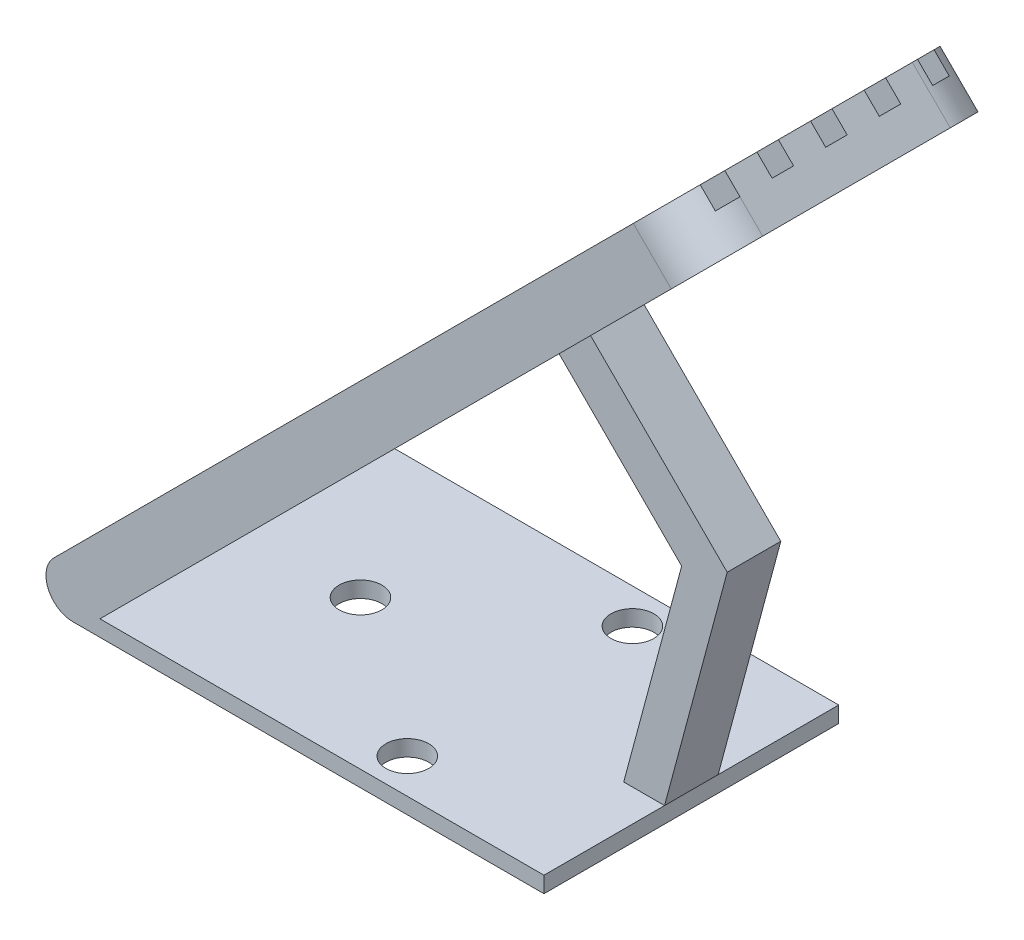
ISO-10303-21;
HEADER;
FILE_DESCRIPTION(('STEP AP214'),'2;1');
FILE_NAME('part.step','',(''),(''),'','','');
FILE_SCHEMA(('AUTOMOTIVE_DESIGN { 1 0 10303 214 1 1 1 1 }'));
ENDSEC;
DATA;
#1=APPLICATION_CONTEXT('core data for automotive mechanical design processes');
#2=APPLICATION_PROTOCOL_DEFINITION('international standard','automotive_design',2000,#1);
#3=PRODUCT_CONTEXT('',#1,'mechanical');
#4=PRODUCT('Part','Part','',(#3));
#5=PRODUCT_RELATED_PRODUCT_CATEGORY('part','',(#4));
#6=PRODUCT_DEFINITION_FORMATION('','',#4);
#7=PRODUCT_DEFINITION_CONTEXT('part definition',#1,'design');
#8=PRODUCT_DEFINITION('design','',#6,#7);
#9=PRODUCT_DEFINITION_SHAPE('','',#8);
#10=(LENGTH_UNIT() NAMED_UNIT(*) SI_UNIT(.MILLI.,.METRE.));
#11=(NAMED_UNIT(*) PLANE_ANGLE_UNIT() SI_UNIT($,.RADIAN.));
#12=(NAMED_UNIT(*) SI_UNIT($,.STERADIAN.) SOLID_ANGLE_UNIT());
#13=UNCERTAINTY_MEASURE_WITH_UNIT(LENGTH_MEASURE(1.E-05),#10,'distance_accuracy_value','');
#14=(GEOMETRIC_REPRESENTATION_CONTEXT(3) GLOBAL_UNCERTAINTY_ASSIGNED_CONTEXT((#13)) GLOBAL_UNIT_ASSIGNED_CONTEXT((#10,
#11,#12)) REPRESENTATION_CONTEXT('',''));
#15=CARTESIAN_POINT('',(0.,0.,0.));
#16=DIRECTION('',(0.,0.,1.));
#17=DIRECTION('',(1.,0.,0.));
#18=AXIS2_PLACEMENT_3D('',#15,#16,#17);
#19=CARTESIAN_POINT('',(-49.9999999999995,50.,27.5));
#20=DIRECTION('',(-0.707106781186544,0.707106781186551,0.));
#21=DIRECTION('',(-0.707106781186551,-0.707106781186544,0.));
#22=AXIS2_PLACEMENT_3D('',#19,#20,#21);
#23=PLANE('',#22);
#24=DIRECTION('',(0.70710678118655,0.707106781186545,0.));
#25=VECTOR('',#24,1.);
#26=CARTESIAN_POINT('',(-96.4644660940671,3.5355339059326,11.5));
#27=LINE('',#26,#25);
#28=CARTESIAN_POINT('',(-91.464466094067,8.53553390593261,11.5));
#29=VERTEX_POINT('',#28);
#30=CARTESIAN_POINT('',(23.7436867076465,123.743686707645,11.5));
#31=VERTEX_POINT('',#30);
#32=EDGE_CURVE('E301',#29,#31,#27,.T.);
#33=ORIENTED_EDGE('',*,*,#32,.F.);
#34=DIRECTION('',(0.,0.,-1.));
#35=VECTOR('',#34,1.);
#36=CARTESIAN_POINT('',(-91.4644660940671,8.53553390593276,27.5));
#37=LINE('',#36,#35);
#38=CARTESIAN_POINT('',(-91.464466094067,8.53553390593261,17.5));
#39=VERTEX_POINT('',#38);
#40=EDGE_CURVE('E507',#39,#29,#37,.T.);
#41=ORIENTED_EDGE('',*,*,#40,.F.);
#42=DIRECTION('',(0.70710678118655,0.707106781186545,0.));
#43=VECTOR('',#42,1.);
#44=CARTESIAN_POINT('',(-96.464466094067,3.53553390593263,17.5));
#45=LINE('',#44,#43);
#46=CARTESIAN_POINT('',(23.7436867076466,123.743686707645,17.5));
#47=VERTEX_POINT('',#46);
#48=EDGE_CURVE('E390',#39,#47,#45,.T.);
#49=ORIENTED_EDGE('',*,*,#48,.T.);
#50=DIRECTION('',(0.,0.,-1.));
#51=VECTOR('',#50,1.);
#52=CARTESIAN_POINT('',(23.7436867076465,123.743686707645,27.5));
#53=LINE('',#52,#51);
#54=EDGE_CURVE('E488',#47,#31,#53,.T.);
#55=ORIENTED_EDGE('',*,*,#54,.T.);
#56=EDGE_LOOP('',(#33,#41,#49,#55));
#57=FACE_BOUND('',#56,.T.);
#58=ADVANCED_FACE('F45',(#57),#23,.T.);
#59=DIRECTION('',(0.70710678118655,0.707106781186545,0.));
#60=VECTOR('',#59,1.);
#61=CARTESIAN_POINT('',(-96.4644660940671,3.5355339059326,7.5));
#62=LINE('',#61,#60);
#63=CARTESIAN_POINT('',(-91.464466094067,8.53553390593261,7.5));
#64=VERTEX_POINT('',#63);
#65=CARTESIAN_POINT('',(23.7436867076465,123.743686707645,7.5));
#66=VERTEX_POINT('',#65);
#67=EDGE_CURVE('E279',#64,#66,#62,.T.);
#68=ORIENTED_EDGE('',*,*,#67,.T.);
#69=CARTESIAN_POINT('',(23.7436867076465,123.743686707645,1.5));
#70=VERTEX_POINT('',#69);
#71=EDGE_CURVE('E296',#66,#70,#53,.T.);
#72=ORIENTED_EDGE('',*,*,#71,.T.);
#73=DIRECTION('',(0.70710678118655,0.707106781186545,0.));
#74=VECTOR('',#73,1.);
#75=CARTESIAN_POINT('',(-96.464466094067,3.53553390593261,1.5));
#76=LINE('',#75,#74);
#77=CARTESIAN_POINT('',(-91.464466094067,8.53553390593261,1.5));
#78=VERTEX_POINT('',#77);
#79=EDGE_CURVE('E314',#78,#70,#76,.T.);
#80=ORIENTED_EDGE('',*,*,#79,.F.);
#81=EDGE_CURVE('E579',#64,#78,#37,.T.);
#82=ORIENTED_EDGE('',*,*,#81,.F.);
#83=EDGE_LOOP('',(#68,#72,#80,#82));
#84=FACE_BOUND('',#83,.T.);
#85=ADVANCED_FACE('F651',(#84),#23,.T.);
#86=DIRECTION('',(0.70710678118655,0.707106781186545,0.));
#87=VECTOR('',#86,1.);
#88=CARTESIAN_POINT('',(-96.464466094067,3.53553390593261,-2.5));
#89=LINE('',#88,#87);
#90=CARTESIAN_POINT('',(-91.464466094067,8.53553390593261,-2.5));
#91=VERTEX_POINT('',#90);
#92=CARTESIAN_POINT('',(23.7436867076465,123.743686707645,-2.5));
#93=VERTEX_POINT('',#92);
#94=EDGE_CURVE('E316',#91,#93,#89,.T.);
#95=ORIENTED_EDGE('',*,*,#94,.T.);
#96=CARTESIAN_POINT('',(23.7436867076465,123.743686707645,-8.5));
#97=VERTEX_POINT('',#96);
#98=EDGE_CURVE('E487',#93,#97,#53,.T.);
#99=ORIENTED_EDGE('',*,*,#98,.T.);
#100=DIRECTION('',(0.70710678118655,0.707106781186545,0.));
#101=VECTOR('',#100,1.);
#102=CARTESIAN_POINT('',(-96.464466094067,3.5355339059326,-8.5));
#103=LINE('',#102,#101);
#104=CARTESIAN_POINT('',(-91.464466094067,8.5355339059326,-8.5));
#105=VERTEX_POINT('',#104);
#106=EDGE_CURVE('E308',#105,#97,#103,.T.);
#107=ORIENTED_EDGE('',*,*,#106,.F.);
#108=EDGE_CURVE('E578',#91,#105,#37,.T.);
#109=ORIENTED_EDGE('',*,*,#108,.F.);
#110=EDGE_LOOP('',(#95,#99,#107,#109));
#111=FACE_BOUND('',#110,.T.);
#112=ADVANCED_FACE('F559',(#111),#23,.T.);
#113=CARTESIAN_POINT('',(23.7436867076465,123.743686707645,-12.5));
#114=VERTEX_POINT('',#113);
#115=CARTESIAN_POINT('',(23.7436867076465,123.743686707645,-17.5));
#116=VERTEX_POINT('',#115);
#117=EDGE_CURVE('E469',#114,#116,#53,.T.);
#118=ORIENTED_EDGE('',*,*,#117,.T.);
#119=CARTESIAN_POINT('',(16.672618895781,116.67261889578,-17.5));
#120=DIRECTION('',(-0.707106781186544,0.707106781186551,0.));
#121=DIRECTION('',(-0.707106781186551,-0.707106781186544,0.));
#122=AXIS2_PLACEMENT_3D('',#119,#120,#121);
#123=CIRCLE('',#122,10.);
#124=CARTESIAN_POINT('',(23.7082425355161,123.708242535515,-18.5));
#125=VERTEX_POINT('',#124);
#126=EDGE_CURVE('E519',#116,#125,#123,.T.);
#127=ORIENTED_EDGE('',*,*,#126,.T.);
#128=DIRECTION('',(0.70710678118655,0.707106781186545,0.));
#129=VECTOR('',#128,1.);
#130=CARTESIAN_POINT('',(-96.464466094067,3.5355339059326,-18.5));
#131=LINE('',#130,#129);
#132=CARTESIAN_POINT('',(-91.464466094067,8.53553390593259,-18.5));
#133=VERTEX_POINT('',#132);
#134=EDGE_CURVE('E326',#133,#125,#131,.T.);
#135=ORIENTED_EDGE('',*,*,#134,.F.);
#136=CARTESIAN_POINT('',(-91.464466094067,8.5355339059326,-12.5));
#137=VERTEX_POINT('',#136);
#138=EDGE_CURVE('E580',#137,#133,#37,.T.);
#139=ORIENTED_EDGE('',*,*,#138,.F.);
#140=DIRECTION('',(0.70710678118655,0.707106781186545,0.));
#141=VECTOR('',#140,1.);
#142=CARTESIAN_POINT('',(-96.464466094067,3.5355339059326,-12.5));
#143=LINE('',#142,#141);
#144=EDGE_CURVE('E333',#137,#114,#143,.T.);
#145=ORIENTED_EDGE('',*,*,#144,.T.);
#146=EDGE_LOOP('',(#118,#127,#135,#139,#145));
#147=FACE_BOUND('',#146,.T.);
#148=ADVANCED_FACE('F663',(#147),#23,.T.);
#149=DIRECTION('',(0.707106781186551,0.707106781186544,0.));
#150=VECTOR('',#149,1.);
#151=CARTESIAN_POINT('',(-49.9999999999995,50.,27.5));
#152=LINE('',#151,#150);
#153=CARTESIAN_POINT('',(-91.4644660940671,8.53553390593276,27.5));
#154=VERTEX_POINT('',#153);
#155=CARTESIAN_POINT('',(16.672618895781,116.67261889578,27.5));
#156=VERTEX_POINT('',#155);
#157=EDGE_CURVE('E454',#154,#156,#152,.T.);
#158=ORIENTED_EDGE('',*,*,#157,.T.);
#159=CARTESIAN_POINT('',(16.672618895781,116.67261889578,17.5));
#160=DIRECTION('',(-0.707106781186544,0.707106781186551,0.));
#161=DIRECTION('',(-0.707106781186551,-0.707106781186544,0.));
#162=AXIS2_PLACEMENT_3D('',#159,#160,#161);
#163=CIRCLE('',#162,10.);
#164=CARTESIAN_POINT('',(23.1533595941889,123.153359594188,21.5));
#165=VERTEX_POINT('',#164);
#166=EDGE_CURVE('E67',#156,#165,#163,.T.);
#167=ORIENTED_EDGE('',*,*,#166,.T.);
#168=DIRECTION('',(0.70710678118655,0.707106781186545,0.));
#169=VECTOR('',#168,1.);
#170=CARTESIAN_POINT('',(-96.464466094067,3.53553390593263,21.5));
#171=LINE('',#170,#169);
#172=CARTESIAN_POINT('',(-91.464466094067,8.53553390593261,21.5));
#173=VERTEX_POINT('',#172);
#174=EDGE_CURVE('E387',#173,#165,#171,.T.);
#175=ORIENTED_EDGE('',*,*,#174,.F.);
#176=EDGE_CURVE('E503',#154,#173,#37,.T.);
#177=ORIENTED_EDGE('',*,*,#176,.F.);
#178=EDGE_LOOP('',(#158,#167,#175,#177));
#179=FACE_BOUND('',#178,.T.);
#180=ADVANCED_FACE('F538',(#179),#23,.T.);
#181=DIRECTION('',(0.70710678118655,0.707106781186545,0.));
#182=VECTOR('',#181,1.);
#183=CARTESIAN_POINT('',(-96.464466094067,3.5355339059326,-22.5));
#184=LINE('',#183,#182);
#185=CARTESIAN_POINT('',(-91.464466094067,8.53553390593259,-22.5));
#186=VERTEX_POINT('',#185);
#187=CARTESIAN_POINT('',(22.7963432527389,122.796343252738,-22.5));
#188=VERTEX_POINT('',#187);
#189=EDGE_CURVE('E342',#186,#188,#184,.T.);
#190=ORIENTED_EDGE('',*,*,#189,.T.);
#191=CARTESIAN_POINT('',(16.672618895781,116.67261889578,-17.5));
#192=DIRECTION('',(-0.707106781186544,0.707106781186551,0.));
#193=DIRECTION('',(-0.707106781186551,-0.707106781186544,0.));
#194=AXIS2_PLACEMENT_3D('',#191,#192,#193);
#195=CIRCLE('',#194,10.);
#196=CARTESIAN_POINT('',(16.672618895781,116.67261889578,-27.5));
#197=VERTEX_POINT('',#196);
#198=EDGE_CURVE('E527',#188,#197,#195,.T.);
#199=ORIENTED_EDGE('',*,*,#198,.T.);
#200=DIRECTION('',(0.707106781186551,0.707106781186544,0.));
#201=VECTOR('',#200,1.);
#202=CARTESIAN_POINT('',(-49.9999999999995,50.,-27.5));
#203=LINE('',#202,#201);
#204=CARTESIAN_POINT('',(-91.4644660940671,8.53553390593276,-27.5));
#205=VERTEX_POINT('',#204);
#206=EDGE_CURVE('E453',#205,#197,#203,.T.);
#207=ORIENTED_EDGE('',*,*,#206,.F.);
#208=EDGE_CURVE('E502',#186,#205,#37,.T.);
#209=ORIENTED_EDGE('',*,*,#208,.F.);
#210=EDGE_LOOP('',(#190,#199,#207,#209));
#211=FACE_BOUND('',#210,.T.);
#212=ADVANCED_FACE('F592',(#211),#23,.T.);
#213=CARTESIAN_POINT('',(-87.9289321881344,4.99999999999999,27.5));
#214=DIRECTION('',(0.,0.,-1.));
#215=DIRECTION('',(-1.,0.,0.));
#216=AXIS2_PLACEMENT_3D('',#213,#214,#215);
#217=CYLINDRICAL_SURFACE('',#216,5.);
#218=ORIENTED_EDGE('',*,*,#40,.T.);
#219=CARTESIAN_POINT('',(-87.9289321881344,4.99999999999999,11.5));
#220=DIRECTION('',(0.,0.,1.));
#221=DIRECTION('',(0.,-1.,0.));
#222=AXIS2_PLACEMENT_3D('',#219,#220,#221);
#223=CIRCLE('',#222,5.);
#224=CARTESIAN_POINT('',(-92.1001405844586,2.24300516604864,11.5));
#225=VERTEX_POINT('',#224);
#226=EDGE_CURVE('E381',#29,#225,#223,.T.);
#227=ORIENTED_EDGE('',*,*,#226,.T.);
#228=DIRECTION('',(0.,0.,-1.));
#229=VECTOR('',#228,1.);
#230=CARTESIAN_POINT('',(-92.1001405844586,2.24300516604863,27.5));
#231=LINE('',#230,#229);
#232=CARTESIAN_POINT('',(-92.1001405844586,2.24300516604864,7.5));
#233=VERTEX_POINT('',#232);
#234=EDGE_CURVE('E378',#225,#233,#231,.T.);
#235=ORIENTED_EDGE('',*,*,#234,.T.);
#236=CARTESIAN_POINT('',(-87.9289321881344,4.99999999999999,7.5));
#237=DIRECTION('',(0.,0.,-1.));
#238=DIRECTION('',(-1.,0.,0.));
#239=AXIS2_PLACEMENT_3D('',#236,#237,#238);
#240=CIRCLE('',#239,5.);
#241=EDGE_CURVE('E276',#233,#64,#240,.T.);
#242=ORIENTED_EDGE('',*,*,#241,.T.);
#243=ORIENTED_EDGE('',*,*,#81,.T.);
#244=CARTESIAN_POINT('',(-87.9289321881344,4.99999999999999,1.5));
#245=DIRECTION('',(0.,0.,1.));
#246=DIRECTION('',(0.,-1.,0.));
#247=AXIS2_PLACEMENT_3D('',#244,#245,#246);
#248=CIRCLE('',#247,5.);
#249=CARTESIAN_POINT('',(-92.1001405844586,2.24300516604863,1.5));
#250=VERTEX_POINT('',#249);
#251=EDGE_CURVE('E375',#78,#250,#248,.T.);
#252=ORIENTED_EDGE('',*,*,#251,.T.);
#253=DIRECTION('',(0.,0.,-1.));
#254=VECTOR('',#253,1.);
#255=CARTESIAN_POINT('',(-92.1001405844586,2.24300516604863,27.5));
#256=LINE('',#255,#254);
#257=CARTESIAN_POINT('',(-92.1001405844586,2.24300516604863,-2.5));
#258=VERTEX_POINT('',#257);
#259=EDGE_CURVE('E369',#250,#258,#256,.T.);
#260=ORIENTED_EDGE('',*,*,#259,.T.);
#261=CARTESIAN_POINT('',(-87.9289321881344,4.99999999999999,-2.5));
#262=DIRECTION('',(0.,0.,-1.));
#263=DIRECTION('',(-1.,0.,0.));
#264=AXIS2_PLACEMENT_3D('',#261,#262,#263);
#265=CIRCLE('',#264,5.);
#266=EDGE_CURVE('E372',#258,#91,#265,.T.);
#267=ORIENTED_EDGE('',*,*,#266,.T.);
#268=ORIENTED_EDGE('',*,*,#108,.T.);
#269=CARTESIAN_POINT('',(-87.9289321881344,4.99999999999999,-8.5));
#270=DIRECTION('',(0.,0.,1.));
#271=DIRECTION('',(0.,-1.,0.));
#272=AXIS2_PLACEMENT_3D('',#269,#270,#271);
#273=CIRCLE('',#272,5.);
#274=CARTESIAN_POINT('',(-92.1001405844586,2.24300516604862,-8.5));
#275=VERTEX_POINT('',#274);
#276=EDGE_CURVE('E366',#105,#275,#273,.T.);
#277=ORIENTED_EDGE('',*,*,#276,.T.);
#278=DIRECTION('',(0.,0.,-1.));
#279=VECTOR('',#278,1.);
#280=CARTESIAN_POINT('',(-92.1001405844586,2.24300516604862,27.5));
#281=LINE('',#280,#279);
#282=CARTESIAN_POINT('',(-92.1001405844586,2.24300516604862,-12.5));
#283=VERTEX_POINT('',#282);
#284=EDGE_CURVE('E360',#275,#283,#281,.T.);
#285=ORIENTED_EDGE('',*,*,#284,.T.);
#286=CARTESIAN_POINT('',(-87.9289321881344,4.99999999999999,-12.5));
#287=DIRECTION('',(0.,0.,-1.));
#288=DIRECTION('',(-1.,0.,0.));
#289=AXIS2_PLACEMENT_3D('',#286,#287,#288);
#290=CIRCLE('',#289,5.);
#291=EDGE_CURVE('E363',#283,#137,#290,.T.);
#292=ORIENTED_EDGE('',*,*,#291,.T.);
#293=ORIENTED_EDGE('',*,*,#138,.T.);
#294=CARTESIAN_POINT('',(-87.9289321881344,4.99999999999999,-18.5));
#295=DIRECTION('',(0.,0.,1.));
#296=DIRECTION('',(0.,-1.,0.));
#297=AXIS2_PLACEMENT_3D('',#294,#295,#296);
#298=CIRCLE('',#297,5.);
#299=CARTESIAN_POINT('',(-92.1001405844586,2.24300516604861,-18.5));
#300=VERTEX_POINT('',#299);
#301=EDGE_CURVE('E357',#133,#300,#298,.T.);
#302=ORIENTED_EDGE('',*,*,#301,.T.);
#303=DIRECTION('',(0.,0.,-1.));
#304=VECTOR('',#303,1.);
#305=CARTESIAN_POINT('',(-92.1001405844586,2.24300516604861,27.5));
#306=LINE('',#305,#304);
#307=CARTESIAN_POINT('',(-92.1001405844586,2.24300516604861,-22.5));
#308=VERTEX_POINT('',#307);
#309=EDGE_CURVE('E303',#300,#308,#306,.T.);
#310=ORIENTED_EDGE('',*,*,#309,.T.);
#311=CARTESIAN_POINT('',(-87.9289321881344,4.99999999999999,-22.5));
#312=DIRECTION('',(0.,0.,-1.));
#313=DIRECTION('',(-1.,0.,0.));
#314=AXIS2_PLACEMENT_3D('',#311,#312,#313);
#315=CIRCLE('',#314,5.);
#316=EDGE_CURVE('E354',#308,#186,#315,.T.);
#317=ORIENTED_EDGE('',*,*,#316,.T.);
#318=ORIENTED_EDGE('',*,*,#208,.T.);
#319=CARTESIAN_POINT('',(-87.9289321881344,4.99999999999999,-27.5));
#320=DIRECTION('',(0.,0.,1.));
#321=DIRECTION('',(1.,0.,0.));
#322=AXIS2_PLACEMENT_3D('',#319,#320,#321);
#323=CIRCLE('',#322,5.);
#324=CARTESIAN_POINT('',(-87.9289321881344,0.,-27.5));
#325=VERTEX_POINT('',#324);
#326=EDGE_CURVE('E472',#205,#325,#323,.T.);
#327=ORIENTED_EDGE('',*,*,#326,.T.);
#328=DIRECTION('',(0.,0.,-1.));
#329=VECTOR('',#328,1.);
#330=CARTESIAN_POINT('',(-87.9289321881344,0.,27.5));
#331=LINE('',#330,#329);
#332=CARTESIAN_POINT('',(-87.9289321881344,0.,27.5));
#333=VERTEX_POINT('',#332);
#334=EDGE_CURVE('E500',#333,#325,#331,.T.);
#335=ORIENTED_EDGE('',*,*,#334,.F.);
#336=CARTESIAN_POINT('',(-87.9289321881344,4.99999999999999,27.5));
#337=DIRECTION('',(0.,0.,1.));
#338=DIRECTION('',(1.,0.,0.));
#339=AXIS2_PLACEMENT_3D('',#336,#337,#338);
#340=CIRCLE('',#339,5.);
#341=EDGE_CURVE('E456',#154,#333,#340,.T.);
#342=ORIENTED_EDGE('',*,*,#341,.F.);
#343=ORIENTED_EDGE('',*,*,#176,.T.);
#344=CARTESIAN_POINT('',(-87.9289321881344,4.99999999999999,21.5));
#345=DIRECTION('',(0.,0.,1.));
#346=DIRECTION('',(0.,-1.,0.));
#347=AXIS2_PLACEMENT_3D('',#344,#345,#346);
#348=CIRCLE('',#347,5.);
#349=CARTESIAN_POINT('',(-92.1001405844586,2.24300516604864,21.5));
#350=VERTEX_POINT('',#349);
#351=EDGE_CURVE('E402',#173,#350,#348,.T.);
#352=ORIENTED_EDGE('',*,*,#351,.T.);
#353=DIRECTION('',(0.,0.,-1.));
#354=VECTOR('',#353,1.);
#355=CARTESIAN_POINT('',(-92.1001405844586,2.24300516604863,27.5));
#356=LINE('',#355,#354);
#357=CARTESIAN_POINT('',(-92.1001405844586,2.24300516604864,17.5));
#358=VERTEX_POINT('',#357);
#359=EDGE_CURVE('E389',#350,#358,#356,.T.);
#360=ORIENTED_EDGE('',*,*,#359,.T.);
#361=CARTESIAN_POINT('',(-87.9289321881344,4.99999999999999,17.5));
#362=DIRECTION('',(0.,0.,-1.));
#363=DIRECTION('',(-1.,0.,0.));
#364=AXIS2_PLACEMENT_3D('',#361,#362,#363);
#365=CIRCLE('',#364,5.);
#366=EDGE_CURVE('E399',#358,#39,#365,.T.);
#367=ORIENTED_EDGE('',*,*,#366,.T.);
#368=EDGE_LOOP('',(#218,#227,#235,#242,#243,#252,#260,#267,#268,#277,#285,#292,#293,#302,#310,
#317,#318,#327,#335,#342,#343,#352,#360,#367));
#369=FACE_BOUND('',#368,.T.);
#370=ADVANCED_FACE('F575',(#369),#217,.T.);
#371=CARTESIAN_POINT('',(0.,0.,27.5));
#372=DIRECTION('',(0.,-1.,0.));
#373=DIRECTION('',(1.,0.,0.));
#374=AXIS2_PLACEMENT_3D('',#371,#372,#373);
#375=PLANE('',#374);
#376=CARTESIAN_POINT('',(-32.,0.,21.));
#377=DIRECTION('',(0.,-1.,0.));
#378=DIRECTION('',(1.,0.,0.));
#379=AXIS2_PLACEMENT_3D('',#376,#377,#378);
#380=CIRCLE('',#379,4.);
#381=CARTESIAN_POINT('',(-28.,0.,21.));
#382=VERTEX_POINT('',#381);
#383=EDGE_CURVE('E853',#382,#382,#380,.T.);
#384=ORIENTED_EDGE('',*,*,#383,.F.);
#385=EDGE_LOOP('',(#384));
#386=FACE_BOUND('',#385,.T.);
#387=CARTESIAN_POINT('',(-32.,0.,-21.));
#388=DIRECTION('',(0.,-1.,0.));
#389=DIRECTION('',(1.,0.,0.));
#390=AXIS2_PLACEMENT_3D('',#387,#388,#389);
#391=CIRCLE('',#390,4.);
#392=CARTESIAN_POINT('',(-28.,0.,-21.));
#393=VERTEX_POINT('',#392);
#394=EDGE_CURVE('E858',#393,#393,#391,.T.);
#395=ORIENTED_EDGE('',*,*,#394,.F.);
#396=EDGE_LOOP('',(#395));
#397=FACE_BOUND('',#396,.T.);
#398=CARTESIAN_POINT('',(-62.,0.,-0.259792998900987));
#399=DIRECTION('',(0.,-1.,0.));
#400=DIRECTION('',(1.,0.,0.));
#401=AXIS2_PLACEMENT_3D('',#398,#399,#400);
#402=CIRCLE('',#401,4.);
#403=CARTESIAN_POINT('',(-58.,0.,-0.259792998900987));
#404=VERTEX_POINT('',#403);
#405=EDGE_CURVE('E864',#404,#404,#402,.T.);
#406=ORIENTED_EDGE('',*,*,#405,.F.);
#407=EDGE_LOOP('',(#406));
#408=FACE_BOUND('',#407,.T.);
#409=DIRECTION('',(-1.,0.,0.));
#410=VECTOR('',#409,1.);
#411=CARTESIAN_POINT('',(0.,0.,-27.5));
#412=LINE('',#411,#410);
#413=CARTESIAN_POINT('',(0.,0.,-27.5));
#414=VERTEX_POINT('',#413);
#415=EDGE_CURVE('E475',#414,#325,#412,.T.);
#416=ORIENTED_EDGE('',*,*,#415,.F.);
#417=DIRECTION('',(0.,0.,-1.));
#418=VECTOR('',#417,1.);
#419=CARTESIAN_POINT('',(0.,0.,27.5));
#420=LINE('',#419,#418);
#421=CARTESIAN_POINT('',(0.,0.,27.5));
#422=VERTEX_POINT('',#421);
#423=EDGE_CURVE('E498',#422,#414,#420,.T.);
#424=ORIENTED_EDGE('',*,*,#423,.F.);
#425=DIRECTION('',(-1.,0.,0.));
#426=VECTOR('',#425,1.);
#427=CARTESIAN_POINT('',(0.,0.,27.5));
#428=LINE('',#427,#426);
#429=EDGE_CURVE('E459',#422,#333,#428,.T.);
#430=ORIENTED_EDGE('',*,*,#429,.T.);
#431=ORIENTED_EDGE('',*,*,#334,.T.);
#432=EDGE_LOOP('',(#416,#424,#430,#431));
#433=FACE_BOUND('',#432,.T.);
#434=ADVANCED_FACE('F611',(#386,#397,#408,#433),#375,.T.);
#435=CARTESIAN_POINT('',(0.,0.,27.5));
#436=DIRECTION('',(-1.,0.,0.));
#437=DIRECTION('',(0.,0.,1.));
#438=AXIS2_PLACEMENT_3D('',#435,#436,#437);
#439=PLANE('',#438);
#440=DIRECTION('',(0.,1.,0.));
#441=VECTOR('',#440,1.);
#442=CARTESIAN_POINT('',(0.,0.,-27.5));
#443=LINE('',#442,#441);
#444=CARTESIAN_POINT('',(0.,2.99999999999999,-27.5));
#445=VERTEX_POINT('',#444);
#446=EDGE_CURVE('E478',#414,#445,#443,.T.);
#447=ORIENTED_EDGE('',*,*,#446,.T.);
#448=DIRECTION('',(0.,0.,-1.));
#449=VECTOR('',#448,1.);
#450=CARTESIAN_POINT('',(0.,2.99999999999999,27.5));
#451=LINE('',#450,#449);
#452=CARTESIAN_POINT('',(0.,2.99999999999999,-5.));
#453=VERTEX_POINT('',#452);
#454=EDGE_CURVE('E494',#453,#445,#451,.T.);
#455=ORIENTED_EDGE('',*,*,#454,.F.);
#456=DIRECTION('',(0.,0.,-1.));
#457=VECTOR('',#456,1.);
#458=CARTESIAN_POINT('',(0.,2.99999999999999,5.));
#459=LINE('',#458,#457);
#460=CARTESIAN_POINT('',(0.,2.99999999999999,5.));
#461=VERTEX_POINT('',#460);
#462=EDGE_CURVE('E445',#461,#453,#459,.T.);
#463=ORIENTED_EDGE('',*,*,#462,.F.);
#464=CARTESIAN_POINT('',(0.,2.99999999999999,27.5));
#465=VERTEX_POINT('',#464);
#466=EDGE_CURVE('E495',#465,#461,#451,.T.);
#467=ORIENTED_EDGE('',*,*,#466,.F.);
#468=DIRECTION('',(0.,1.,0.));
#469=VECTOR('',#468,1.);
#470=CARTESIAN_POINT('',(0.,0.,27.5));
#471=LINE('',#470,#469);
#472=EDGE_CURVE('E462',#422,#465,#471,.T.);
#473=ORIENTED_EDGE('',*,*,#472,.F.);
#474=ORIENTED_EDGE('',*,*,#423,.T.);
#475=EDGE_LOOP('',(#447,#455,#463,#467,#473,#474));
#476=FACE_BOUND('',#475,.T.);
#477=ADVANCED_FACE('F616',(#476),#439,.F.);
#478=CARTESIAN_POINT('',(0.,2.99999999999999,27.5));
#479=DIRECTION('',(0.,1.,0.));
#480=DIRECTION('',(-1.,0.,0.));
#481=AXIS2_PLACEMENT_3D('',#478,#479,#480);
#482=PLANE('',#481);
#483=CARTESIAN_POINT('',(-32.,2.99999999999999,21.));
#484=DIRECTION('',(0.,1.,0.));
#485=DIRECTION('',(-1.,0.,0.));
#486=AXIS2_PLACEMENT_3D('',#483,#484,#485);
#487=CIRCLE('',#486,4.);
#488=CARTESIAN_POINT('',(-36.,2.99999999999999,21.));
#489=VERTEX_POINT('',#488);
#490=EDGE_CURVE('E351',#489,#489,#487,.F.);
#491=ORIENTED_EDGE('',*,*,#490,.T.);
#492=EDGE_LOOP('',(#491));
#493=FACE_BOUND('',#492,.T.);
#494=CARTESIAN_POINT('',(-32.,2.99999999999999,-21.));
#495=DIRECTION('',(0.,1.,0.));
#496=DIRECTION('',(-1.,0.,0.));
#497=AXIS2_PLACEMENT_3D('',#494,#495,#496);
#498=CIRCLE('',#497,4.);
#499=CARTESIAN_POINT('',(-36.,2.99999999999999,-21.));
#500=VERTEX_POINT('',#499);
#501=EDGE_CURVE('E861',#500,#500,#498,.F.);
#502=ORIENTED_EDGE('',*,*,#501,.T.);
#503=EDGE_LOOP('',(#502));
#504=FACE_BOUND('',#503,.T.);
#505=CARTESIAN_POINT('',(-62.,2.99999999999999,-0.259792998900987));
#506=DIRECTION('',(0.,1.,0.));
#507=DIRECTION('',(-1.,0.,0.));
#508=AXIS2_PLACEMENT_3D('',#505,#506,#507);
#509=CIRCLE('',#508,4.);
#510=CARTESIAN_POINT('',(-66.,2.99999999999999,-0.259792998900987));
#511=VERTEX_POINT('',#510);
#512=EDGE_CURVE('E867',#511,#511,#509,.F.);
#513=ORIENTED_EDGE('',*,*,#512,.T.);
#514=EDGE_LOOP('',(#513));
#515=FACE_BOUND('',#514,.T.);
#516=DIRECTION('',(1.,0.,0.));
#517=VECTOR('',#516,1.);
#518=CARTESIAN_POINT('',(0.,2.99999999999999,5.));
#519=LINE('',#518,#517);
#520=CARTESIAN_POINT('',(-7.6221611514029,2.99999999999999,5.));
#521=VERTEX_POINT('',#520);
#522=EDGE_CURVE('E413',#521,#461,#519,.T.);
#523=ORIENTED_EDGE('',*,*,#522,.F.);
#524=DIRECTION('',(0.,0.,-1.));
#525=VECTOR('',#524,1.);
#526=CARTESIAN_POINT('',(-7.6221611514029,2.99999999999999,5.));
#527=LINE('',#526,#525);
#528=CARTESIAN_POINT('',(-7.6221611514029,2.99999999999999,-5.));
#529=VERTEX_POINT('',#528);
#530=EDGE_CURVE('E448',#521,#529,#527,.T.);
#531=ORIENTED_EDGE('',*,*,#530,.T.);
#532=DIRECTION('',(1.,0.,0.));
#533=VECTOR('',#532,1.);
#534=CARTESIAN_POINT('',(0.,2.99999999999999,-5.));
#535=LINE('',#534,#533);
#536=EDGE_CURVE('E428',#529,#453,#535,.T.);
#537=ORIENTED_EDGE('',*,*,#536,.T.);
#538=ORIENTED_EDGE('',*,*,#454,.T.);
#539=DIRECTION('',(1.,0.,0.));
#540=VECTOR('',#539,1.);
#541=CARTESIAN_POINT('',(0.,2.99999999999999,-27.5));
#542=LINE('',#541,#540);
#543=CARTESIAN_POINT('',(-82.8578643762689,3.00000000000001,-27.5));
#544=VERTEX_POINT('',#543);
#545=EDGE_CURVE('E481',#544,#445,#542,.T.);
#546=ORIENTED_EDGE('',*,*,#545,.F.);
#547=DIRECTION('',(0.,0.,-1.));
#548=VECTOR('',#547,1.);
#549=CARTESIAN_POINT('',(-82.8578643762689,3.00000000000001,27.5));
#550=LINE('',#549,#548);
#551=CARTESIAN_POINT('',(-82.8578643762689,3.00000000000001,27.5));
#552=VERTEX_POINT('',#551);
#553=EDGE_CURVE('E491',#552,#544,#550,.T.);
#554=ORIENTED_EDGE('',*,*,#553,.F.);
#555=DIRECTION('',(1.,0.,0.));
#556=VECTOR('',#555,1.);
#557=CARTESIAN_POINT('',(0.,2.99999999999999,27.5));
#558=LINE('',#557,#556);
#559=EDGE_CURVE('E464',#552,#465,#558,.T.);
#560=ORIENTED_EDGE('',*,*,#559,.T.);
#561=ORIENTED_EDGE('',*,*,#466,.T.);
#562=EDGE_LOOP('',(#523,#531,#537,#538,#546,#554,#560,#561));
#563=FACE_BOUND('',#562,.T.);
#564=ADVANCED_FACE('F607',(#493,#504,#515,#563),#482,.T.);
#565=CARTESIAN_POINT('',(-42.928932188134,42.9289321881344,27.5));
#566=DIRECTION('',(0.707106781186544,-0.707106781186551,0.));
#567=DIRECTION('',(0.707106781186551,0.707106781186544,0.));
#568=AXIS2_PLACEMENT_3D('',#565,#566,#567);
#569=PLANE('',#568);
#570=DIRECTION('',(-0.707106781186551,-0.707106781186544,0.));
#571=VECTOR('',#570,1.);
#572=CARTESIAN_POINT('',(-42.928932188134,42.9289321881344,5.));
#573=LINE('',#572,#571);
#574=CARTESIAN_POINT('',(-13.8090025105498,72.0488618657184,5.));
#575=VERTEX_POINT('',#574);
#576=CARTESIAN_POINT('',(-19.6844365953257,66.1734277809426,5.));
#577=VERTEX_POINT('',#576);
#578=EDGE_CURVE('E421',#575,#577,#573,.T.);
#579=ORIENTED_EDGE('',*,*,#578,.F.);
#580=DIRECTION('',(0.,0.,-1.));
#581=VECTOR('',#580,1.);
#582=CARTESIAN_POINT('',(-13.8090025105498,72.0488618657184,5.));
#583=LINE('',#582,#581);
#584=CARTESIAN_POINT('',(-13.8090025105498,72.0488618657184,-5.));
#585=VERTEX_POINT('',#584);
#586=EDGE_CURVE('E440',#575,#585,#583,.T.);
#587=ORIENTED_EDGE('',*,*,#586,.T.);
#588=DIRECTION('',(-0.707106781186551,-0.707106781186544,0.));
#589=VECTOR('',#588,1.);
#590=CARTESIAN_POINT('',(-42.928932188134,42.9289321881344,-5.));
#591=LINE('',#590,#589);
#592=CARTESIAN_POINT('',(-19.6844365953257,66.1734277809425,-5.));
#593=VERTEX_POINT('',#592);
#594=EDGE_CURVE('E410',#585,#593,#591,.T.);
#595=ORIENTED_EDGE('',*,*,#594,.T.);
#596=DIRECTION('',(0.,0.,-1.));
#597=VECTOR('',#596,1.);
#598=CARTESIAN_POINT('',(-19.6844365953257,66.1734277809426,5.));
#599=LINE('',#598,#597);
#600=EDGE_CURVE('E423',#577,#593,#599,.T.);
#601=ORIENTED_EDGE('',*,*,#600,.F.);
#602=EDGE_LOOP('',(#579,#587,#595,#601));
#603=FACE_BOUND('',#602,.T.);
#604=DIRECTION('',(-0.707106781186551,-0.707106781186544,0.));
#605=VECTOR('',#604,1.);
#606=CARTESIAN_POINT('',(-42.928932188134,42.9289321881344,-27.5));
#607=LINE('',#606,#605);
#608=CARTESIAN_POINT('',(23.7436867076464,109.601551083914,-27.5));
#609=VERTEX_POINT('',#608);
#610=EDGE_CURVE('E457',#609,#544,#607,.T.);
#611=ORIENTED_EDGE('',*,*,#610,.F.);
#612=CARTESIAN_POINT('',(23.7436867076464,109.601551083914,-17.5));
#613=DIRECTION('',(0.707106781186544,-0.707106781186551,0.));
#614=DIRECTION('',(0.707106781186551,0.707106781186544,0.));
#615=AXIS2_PLACEMENT_3D('',#612,#613,#614);
#616=CIRCLE('',#615,10.);
#617=CARTESIAN_POINT('',(30.8147545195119,116.67261889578,-17.5));
#618=VERTEX_POINT('',#617);
#619=EDGE_CURVE('E512',#609,#618,#616,.T.);
#620=ORIENTED_EDGE('',*,*,#619,.T.);
#621=DIRECTION('',(0.,0.,-1.));
#622=VECTOR('',#621,1.);
#623=CARTESIAN_POINT('',(30.8147545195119,116.67261889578,27.5));
#624=LINE('',#623,#622);
#625=CARTESIAN_POINT('',(30.8147545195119,116.67261889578,17.5));
#626=VERTEX_POINT('',#625);
#627=EDGE_CURVE('E489',#626,#618,#624,.T.);
#628=ORIENTED_EDGE('',*,*,#627,.F.);
#629=CARTESIAN_POINT('',(23.7436867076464,109.601551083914,17.5));
#630=DIRECTION('',(0.707106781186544,-0.707106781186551,0.));
#631=DIRECTION('',(0.707106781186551,0.707106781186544,0.));
#632=AXIS2_PLACEMENT_3D('',#629,#630,#631);
#633=CIRCLE('',#632,10.);
#634=CARTESIAN_POINT('',(23.7436867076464,109.601551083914,27.5));
#635=VERTEX_POINT('',#634);
#636=EDGE_CURVE('E510',#626,#635,#633,.T.);
#637=ORIENTED_EDGE('',*,*,#636,.T.);
#638=DIRECTION('',(-0.707106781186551,-0.707106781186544,0.));
#639=VECTOR('',#638,1.);
#640=CARTESIAN_POINT('',(-42.928932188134,42.9289321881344,27.5));
#641=LINE('',#640,#639);
#642=EDGE_CURVE('E467',#635,#552,#641,.T.);
#643=ORIENTED_EDGE('',*,*,#642,.T.);
#644=ORIENTED_EDGE('',*,*,#553,.T.);
#645=EDGE_LOOP('',(#611,#620,#628,#637,#643,#644));
#646=FACE_BOUND('',#645,.T.);
#647=ADVANCED_FACE('F602',(#603,#646),#569,.T.);
#648=CARTESIAN_POINT('',(73.7436867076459,73.7436867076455,27.5));
#649=DIRECTION('',(0.70710678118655,0.707106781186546,0.));
#650=DIRECTION('',(-0.707106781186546,0.70710678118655,0.));
#651=AXIS2_PLACEMENT_3D('',#648,#649,#650);
#652=PLANE('',#651);
#653=ORIENTED_EDGE('',*,*,#627,.T.);
#654=DIRECTION('',(0.707106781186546,-0.70710678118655,0.));
#655=VECTOR('',#654,1.);
#656=CARTESIAN_POINT('',(23.7436867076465,123.743686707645,-17.5));
#657=LINE('',#656,#655);
#658=EDGE_CURVE('E517',#618,#116,#657,.F.);
#659=ORIENTED_EDGE('',*,*,#658,.T.);
#660=ORIENTED_EDGE('',*,*,#117,.F.);
#661=DIRECTION('',(-0.707106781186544,0.707106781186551,0.));
#662=VECTOR('',#661,1.);
#663=CARTESIAN_POINT('',(23.7436867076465,123.743686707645,-12.5));
#664=LINE('',#663,#662);
#665=CARTESIAN_POINT('',(26.5721138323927,120.915259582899,-12.5));
#666=VERTEX_POINT('',#665);
#667=EDGE_CURVE('E329',#666,#114,#664,.T.);
#668=ORIENTED_EDGE('',*,*,#667,.F.);
#669=DIRECTION('',(0.,0.,-1.));
#670=VECTOR('',#669,1.);
#671=CARTESIAN_POINT('',(26.5721138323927,120.915259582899,-8.5));
#672=LINE('',#671,#670);
#673=CARTESIAN_POINT('',(26.5721138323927,120.915259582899,-8.5));
#674=VERTEX_POINT('',#673);
#675=EDGE_CURVE('E325',#674,#666,#672,.T.);
#676=ORIENTED_EDGE('',*,*,#675,.F.);
#677=DIRECTION('',(0.707106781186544,-0.707106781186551,0.));
#678=VECTOR('',#677,1.);
#679=CARTESIAN_POINT('',(23.7436867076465,123.743686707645,-8.5));
#680=LINE('',#679,#678);
#681=EDGE_CURVE('E323',#97,#674,#680,.T.);
#682=ORIENTED_EDGE('',*,*,#681,.F.);
#683=ORIENTED_EDGE('',*,*,#98,.F.);
#684=DIRECTION('',(-0.707106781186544,0.707106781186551,0.));
#685=VECTOR('',#684,1.);
#686=CARTESIAN_POINT('',(23.7436867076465,123.743686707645,-2.5));
#687=LINE('',#686,#685);
#688=CARTESIAN_POINT('',(26.5721138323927,120.915259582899,-2.5));
#689=VERTEX_POINT('',#688);
#690=EDGE_CURVE('E311',#689,#93,#687,.T.);
#691=ORIENTED_EDGE('',*,*,#690,.F.);
#692=DIRECTION('',(0.,0.,-1.));
#693=VECTOR('',#692,1.);
#694=CARTESIAN_POINT('',(26.5721138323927,120.915259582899,1.5));
#695=LINE('',#694,#693);
#696=CARTESIAN_POINT('',(26.5721138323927,120.915259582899,1.5));
#697=VERTEX_POINT('',#696);
#698=EDGE_CURVE('E307',#697,#689,#695,.T.);
#699=ORIENTED_EDGE('',*,*,#698,.F.);
#700=DIRECTION('',(0.707106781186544,-0.707106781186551,0.));
#701=VECTOR('',#700,1.);
#702=CARTESIAN_POINT('',(23.7436867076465,123.743686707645,1.5));
#703=LINE('',#702,#701);
#704=EDGE_CURVE('E305',#70,#697,#703,.T.);
#705=ORIENTED_EDGE('',*,*,#704,.F.);
#706=ORIENTED_EDGE('',*,*,#71,.F.);
#707=DIRECTION('',(-0.707106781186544,0.707106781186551,0.));
#708=VECTOR('',#707,1.);
#709=CARTESIAN_POINT('',(23.7436867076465,123.743686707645,7.5));
#710=LINE('',#709,#708);
#711=CARTESIAN_POINT('',(26.5721138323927,120.915259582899,7.5));
#712=VERTEX_POINT('',#711);
#713=EDGE_CURVE('E273',#712,#66,#710,.T.);
#714=ORIENTED_EDGE('',*,*,#713,.F.);
#715=DIRECTION('',(0.,0.,-1.));
#716=VECTOR('',#715,1.);
#717=CARTESIAN_POINT('',(26.5721138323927,120.915259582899,11.5));
#718=LINE('',#717,#716);
#719=CARTESIAN_POINT('',(26.5721138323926,120.915259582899,11.5));
#720=VERTEX_POINT('',#719);
#721=EDGE_CURVE('E284',#720,#712,#718,.T.);
#722=ORIENTED_EDGE('',*,*,#721,.F.);
#723=DIRECTION('',(0.707106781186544,-0.707106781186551,0.));
#724=VECTOR('',#723,1.);
#725=CARTESIAN_POINT('',(23.7436867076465,123.743686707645,11.5));
#726=LINE('',#725,#724);
#727=EDGE_CURVE('E289',#31,#720,#726,.T.);
#728=ORIENTED_EDGE('',*,*,#727,.F.);
#729=ORIENTED_EDGE('',*,*,#54,.F.);
#730=DIRECTION('',(-0.707106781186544,0.707106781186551,0.));
#731=VECTOR('',#730,1.);
#732=CARTESIAN_POINT('',(23.7436867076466,123.743686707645,17.5));
#733=LINE('',#732,#731);
#734=CARTESIAN_POINT('',(26.5721138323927,120.915259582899,17.5));
#735=VERTEX_POINT('',#734);
#736=EDGE_CURVE('E384',#735,#47,#733,.T.);
#737=ORIENTED_EDGE('',*,*,#736,.F.);
#738=DIRECTION('',(0.707106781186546,-0.70710678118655,0.));
#739=VECTOR('',#738,1.);
#740=CARTESIAN_POINT('',(73.7436867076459,73.7436867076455,17.5));
#741=LINE('',#740,#739);
#742=EDGE_CURVE('E514',#735,#626,#741,.T.);
#743=ORIENTED_EDGE('',*,*,#742,.T.);
#744=EDGE_LOOP('',(#653,#659,#660,#668,#676,#682,#683,#691,#699,#705,#706,#714,#722,#728,#729,
#737,#743));
#745=FACE_BOUND('',#744,.T.);
#746=ADVANCED_FACE('F293',(#745),#652,.T.);
#747=CARTESIAN_POINT('',(0.,0.,27.5));
#748=DIRECTION('',(0.,0.,1.));
#749=DIRECTION('',(1.,0.,0.));
#750=AXIS2_PLACEMENT_3D('',#747,#748,#749);
#751=PLANE('',#750);
#752=ORIENTED_EDGE('',*,*,#642,.F.);
#753=DIRECTION('',(0.707106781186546,-0.70710678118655,0.));
#754=VECTOR('',#753,1.);
#755=CARTESIAN_POINT('',(66.6726188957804,66.67261889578,27.5));
#756=LINE('',#755,#754);
#757=EDGE_CURVE('E529',#635,#156,#756,.F.);
#758=ORIENTED_EDGE('',*,*,#757,.T.);
#759=ORIENTED_EDGE('',*,*,#157,.F.);
#760=ORIENTED_EDGE('',*,*,#341,.T.);
#761=ORIENTED_EDGE('',*,*,#429,.F.);
#762=ORIENTED_EDGE('',*,*,#472,.T.);
#763=ORIENTED_EDGE('',*,*,#559,.F.);
#764=EDGE_LOOP('',(#752,#758,#759,#760,#761,#762,#763));
#765=FACE_BOUND('',#764,.T.);
#766=ADVANCED_FACE('F535',(#765),#751,.T.);
#767=CARTESIAN_POINT('',(0.,0.,-27.5));
#768=DIRECTION('',(0.,0.,1.));
#769=DIRECTION('',(1.,0.,0.));
#770=AXIS2_PLACEMENT_3D('',#767,#768,#769);
#771=PLANE('',#770);
#772=ORIENTED_EDGE('',*,*,#206,.T.);
#773=DIRECTION('',(0.707106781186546,-0.70710678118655,0.));
#774=VECTOR('',#773,1.);
#775=CARTESIAN_POINT('',(23.7436867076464,109.601551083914,-27.5));
#776=LINE('',#775,#774);
#777=EDGE_CURVE('E506',#197,#609,#776,.T.);
#778=ORIENTED_EDGE('',*,*,#777,.T.);
#779=ORIENTED_EDGE('',*,*,#610,.T.);
#780=ORIENTED_EDGE('',*,*,#545,.T.);
#781=ORIENTED_EDGE('',*,*,#446,.F.);
#782=ORIENTED_EDGE('',*,*,#415,.T.);
#783=ORIENTED_EDGE('',*,*,#326,.F.);
#784=EDGE_LOOP('',(#772,#778,#779,#780,#781,#782,#783));
#785=FACE_BOUND('',#784,.T.);
#786=ADVANCED_FACE('F588',(#785),#771,.F.);
#787=CARTESIAN_POINT('',(23.2444955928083,23.2444955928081,5.));
#788=DIRECTION('',(-0.707106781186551,-0.707106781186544,0.));
#789=DIRECTION('',(0.707106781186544,-0.707106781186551,0.));
#790=AXIS2_PLACEMENT_3D('',#787,#788,#789);
#791=PLANE('',#790);
#792=DIRECTION('',(-0.707106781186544,0.707106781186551,0.));
#793=VECTOR('',#792,1.);
#794=CARTESIAN_POINT('',(23.2444955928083,23.2444955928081,-5.));
#795=LINE('',#794,#793);
#796=CARTESIAN_POINT('',(3.19259336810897,43.2963978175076,-5.));
#797=VERTEX_POINT('',#796);
#798=EDGE_CURVE('E405',#797,#593,#795,.T.);
#799=ORIENTED_EDGE('',*,*,#798,.F.);
#800=DIRECTION('',(0.,0.,-1.));
#801=VECTOR('',#800,1.);
#802=CARTESIAN_POINT('',(3.19259336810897,43.2963978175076,5.));
#803=LINE('',#802,#801);
#804=CARTESIAN_POINT('',(3.19259336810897,43.2963978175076,5.));
#805=VERTEX_POINT('',#804);
#806=EDGE_CURVE('E451',#805,#797,#803,.T.);
#807=ORIENTED_EDGE('',*,*,#806,.F.);
#808=DIRECTION('',(-0.707106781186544,0.707106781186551,0.));
#809=VECTOR('',#808,1.);
#810=CARTESIAN_POINT('',(23.2444955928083,23.2444955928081,5.));
#811=LINE('',#810,#809);
#812=EDGE_CURVE('E406',#805,#577,#811,.T.);
#813=ORIENTED_EDGE('',*,*,#812,.T.);
#814=ORIENTED_EDGE('',*,*,#600,.T.);
#815=EDGE_LOOP('',(#799,#807,#813,#814));
#816=FACE_BOUND('',#815,.T.);
#817=ADVANCED_FACE('F634',(#816),#791,.T.);
#818=CARTESIAN_POINT('',(-7.86108414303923,2.10975918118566,5.));
#819=DIRECTION('',(-0.965821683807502,0.259207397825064,0.));
#820=DIRECTION('',(-0.259207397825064,-0.965821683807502,0.));
#821=AXIS2_PLACEMENT_3D('',#818,#819,#820);
#822=PLANE('',#821);
#823=DIRECTION('',(0.259207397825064,0.965821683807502,0.));
#824=VECTOR('',#823,1.);
#825=CARTESIAN_POINT('',(-7.86108414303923,2.10975918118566,-5.));
#826=LINE('',#825,#824);
#827=EDGE_CURVE('E425',#529,#797,#826,.T.);
#828=ORIENTED_EDGE('',*,*,#827,.F.);
#829=ORIENTED_EDGE('',*,*,#530,.F.);
#830=DIRECTION('',(0.259207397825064,0.965821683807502,0.));
#831=VECTOR('',#830,1.);
#832=CARTESIAN_POINT('',(-7.86108414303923,2.10975918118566,5.));
#833=LINE('',#832,#831);
#834=EDGE_CURVE('E409',#521,#805,#833,.T.);
#835=ORIENTED_EDGE('',*,*,#834,.T.);
#836=ORIENTED_EDGE('',*,*,#806,.T.);
#837=EDGE_LOOP('',(#828,#829,#835,#836));
#838=FACE_BOUND('',#837,.T.);
#839=ADVANCED_FACE('F637',(#838),#822,.T.);
#840=CARTESIAN_POINT('',(-0.751044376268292,0.201565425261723,5.));
#841=DIRECTION('',(0.965821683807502,-0.259207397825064,0.));
#842=DIRECTION('',(0.259207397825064,0.965821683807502,0.));
#843=AXIS2_PLACEMENT_3D('',#840,#841,#842);
#844=PLANE('',#843);
#845=DIRECTION('',(-0.259207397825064,-0.965821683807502,0.));
#846=VECTOR('',#845,1.);
#847=CARTESIAN_POINT('',(-0.751044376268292,0.201565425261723,-5.));
#848=LINE('',#847,#846);
#849=CARTESIAN_POINT('',(11.6883594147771,46.5514999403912,-5.));
#850=VERTEX_POINT('',#849);
#851=EDGE_CURVE('E431',#850,#453,#848,.T.);
#852=ORIENTED_EDGE('',*,*,#851,.F.);
#853=DIRECTION('',(0.,0.,-1.));
#854=VECTOR('',#853,1.);
#855=CARTESIAN_POINT('',(11.6883594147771,46.5514999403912,5.));
#856=LINE('',#855,#854);
#857=CARTESIAN_POINT('',(11.6883594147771,46.5514999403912,5.));
#858=VERTEX_POINT('',#857);
#859=EDGE_CURVE('E443',#858,#850,#856,.T.);
#860=ORIENTED_EDGE('',*,*,#859,.F.);
#861=DIRECTION('',(-0.259207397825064,-0.965821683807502,0.));
#862=VECTOR('',#861,1.);
#863=CARTESIAN_POINT('',(-0.751044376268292,0.201565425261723,5.));
#864=LINE('',#863,#862);
#865=EDGE_CURVE('E415',#858,#461,#864,.T.);
#866=ORIENTED_EDGE('',*,*,#865,.T.);
#867=ORIENTED_EDGE('',*,*,#462,.T.);
#868=EDGE_LOOP('',(#852,#860,#866,#867));
#869=FACE_BOUND('',#868,.T.);
#870=ADVANCED_FACE('F625',(#869),#844,.T.);
#871=CARTESIAN_POINT('',(29.1199296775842,29.119929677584,5.));
#872=DIRECTION('',(0.707106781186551,0.707106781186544,0.));
#873=DIRECTION('',(-0.707106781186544,0.707106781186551,0.));
#874=AXIS2_PLACEMENT_3D('',#871,#872,#873);
#875=PLANE('',#874);
#876=DIRECTION('',(0.707106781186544,-0.707106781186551,0.));
#877=VECTOR('',#876,1.);
#878=CARTESIAN_POINT('',(29.1199296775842,29.119929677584,-5.));
#879=LINE('',#878,#877);
#880=EDGE_CURVE('E433',#585,#850,#879,.T.);
#881=ORIENTED_EDGE('',*,*,#880,.F.);
#882=ORIENTED_EDGE('',*,*,#586,.F.);
#883=DIRECTION('',(0.707106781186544,-0.707106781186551,0.));
#884=VECTOR('',#883,1.);
#885=CARTESIAN_POINT('',(29.1199296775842,29.119929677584,5.));
#886=LINE('',#885,#884);
#887=EDGE_CURVE('E418',#575,#858,#886,.T.);
#888=ORIENTED_EDGE('',*,*,#887,.T.);
#889=ORIENTED_EDGE('',*,*,#859,.T.);
#890=EDGE_LOOP('',(#881,#882,#888,#889));
#891=FACE_BOUND('',#890,.T.);
#892=ADVANCED_FACE('F628',(#891),#875,.T.);
#893=CARTESIAN_POINT('',(0.,0.,5.));
#894=DIRECTION('',(0.,0.,1.));
#895=DIRECTION('',(1.,0.,0.));
#896=AXIS2_PLACEMENT_3D('',#893,#894,#895);
#897=PLANE('',#896);
#898=ORIENTED_EDGE('',*,*,#812,.F.);
#899=ORIENTED_EDGE('',*,*,#834,.F.);
#900=ORIENTED_EDGE('',*,*,#522,.T.);
#901=ORIENTED_EDGE('',*,*,#865,.F.);
#902=ORIENTED_EDGE('',*,*,#887,.F.);
#903=ORIENTED_EDGE('',*,*,#578,.T.);
#904=EDGE_LOOP('',(#898,#899,#900,#901,#902,#903));
#905=FACE_BOUND('',#904,.T.);
#906=ADVANCED_FACE('F621',(#905),#897,.T.);
#907=CARTESIAN_POINT('',(0.,0.,-5.));
#908=DIRECTION('',(0.,0.,1.));
#909=DIRECTION('',(1.,0.,0.));
#910=AXIS2_PLACEMENT_3D('',#907,#908,#909);
#911=PLANE('',#910);
#912=ORIENTED_EDGE('',*,*,#798,.T.);
#913=ORIENTED_EDGE('',*,*,#594,.F.);
#914=ORIENTED_EDGE('',*,*,#880,.T.);
#915=ORIENTED_EDGE('',*,*,#851,.T.);
#916=ORIENTED_EDGE('',*,*,#536,.F.);
#917=ORIENTED_EDGE('',*,*,#827,.T.);
#918=EDGE_LOOP('',(#912,#913,#914,#915,#916,#917));
#919=FACE_BOUND('',#918,.T.);
#920=ADVANCED_FACE('F639',(#919),#911,.F.);
#921=CARTESIAN_POINT('',(-96.464466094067,3.53553390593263,21.5));
#922=DIRECTION('',(0.,0.,1.));
#923=DIRECTION('',(0.,-1.,0.));
#924=AXIS2_PLACEMENT_3D('',#921,#922,#923);
#925=PLANE('',#924);
#926=ORIENTED_EDGE('',*,*,#174,.T.);
#927=DIRECTION('',(0.707106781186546,-0.70710678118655,0.));
#928=VECTOR('',#927,1.);
#929=CARTESIAN_POINT('',(23.1533595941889,123.153359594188,21.5));
#930=LINE('',#929,#928);
#931=CARTESIAN_POINT('',(25.981786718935,120.324932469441,21.5));
#932=VERTEX_POINT('',#931);
#933=EDGE_CURVE('E53',#165,#932,#930,.T.);
#934=ORIENTED_EDGE('',*,*,#933,.T.);
#935=DIRECTION('',(0.70710678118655,0.707106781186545,0.));
#936=VECTOR('',#935,1.);
#937=CARTESIAN_POINT('',(-93.6360389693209,0.70710678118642,21.5));
#938=LINE('',#937,#936);
#939=EDGE_CURVE('E386',#350,#932,#938,.T.);
#940=ORIENTED_EDGE('',*,*,#939,.F.);
#941=ORIENTED_EDGE('',*,*,#351,.F.);
#942=EDGE_LOOP('',(#926,#934,#940,#941));
#943=FACE_BOUND('',#942,.T.);
#944=ADVANCED_FACE('F641',(#943),#925,.F.);
#945=CARTESIAN_POINT('',(-96.464466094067,3.53553390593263,17.5));
#946=DIRECTION('',(0.,0.,-1.));
#947=DIRECTION('',(-1.,0.,0.));
#948=AXIS2_PLACEMENT_3D('',#945,#946,#947);
#949=PLANE('',#948);
#950=DIRECTION('',(0.70710678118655,0.707106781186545,0.));
#951=VECTOR('',#950,1.);
#952=CARTESIAN_POINT('',(-93.6360389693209,0.70710678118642,17.5));
#953=LINE('',#952,#951);
#954=EDGE_CURVE('E393',#358,#735,#953,.T.);
#955=ORIENTED_EDGE('',*,*,#954,.T.);
#956=ORIENTED_EDGE('',*,*,#736,.T.);
#957=ORIENTED_EDGE('',*,*,#48,.F.);
#958=ORIENTED_EDGE('',*,*,#366,.F.);
#959=EDGE_LOOP('',(#955,#956,#957,#958));
#960=FACE_BOUND('',#959,.T.);
#961=ADVANCED_FACE('F547',(#960),#949,.F.);
#962=CARTESIAN_POINT('',(-93.6360389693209,0.70710678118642,21.5));
#963=DIRECTION('',(0.707106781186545,-0.70710678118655,0.));
#964=DIRECTION('',(0.70710678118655,0.707106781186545,0.));
#965=AXIS2_PLACEMENT_3D('',#962,#963,#964);
#966=PLANE('',#965);
#967=ORIENTED_EDGE('',*,*,#939,.T.);
#968=CARTESIAN_POINT('',(19.5010460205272,113.844191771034,17.5));
#969=DIRECTION('',(0.707106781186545,-0.70710678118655,0.));
#970=DIRECTION('',(0.70710678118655,0.707106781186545,0.));
#971=AXIS2_PLACEMENT_3D('',#968,#969,#970);
#972=CIRCLE('',#971,10.);
#973=EDGE_CURVE('E11',#932,#735,#972,.F.);
#974=ORIENTED_EDGE('',*,*,#973,.T.);
#975=ORIENTED_EDGE('',*,*,#954,.F.);
#976=ORIENTED_EDGE('',*,*,#359,.F.);
#977=EDGE_LOOP('',(#967,#974,#975,#976));
#978=FACE_BOUND('',#977,.T.);
#979=ADVANCED_FACE('F544',(#978),#966,.F.);
#980=CARTESIAN_POINT('',(-96.464466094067,3.5355339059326,-18.5));
#981=DIRECTION('',(0.,0.,1.));
#982=DIRECTION('',(0.,-1.,0.));
#983=AXIS2_PLACEMENT_3D('',#980,#981,#982);
#984=PLANE('',#983);
#985=ORIENTED_EDGE('',*,*,#134,.T.);
#986=DIRECTION('',(-0.707106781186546,0.70710678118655,0.));
#987=VECTOR('',#986,1.);
#988=CARTESIAN_POINT('',(23.7082425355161,123.708242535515,-18.5));
#989=LINE('',#988,#987);
#990=CARTESIAN_POINT('',(26.5366696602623,120.879815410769,-18.5));
#991=VERTEX_POINT('',#990);
#992=EDGE_CURVE('E521',#125,#991,#989,.F.);
#993=ORIENTED_EDGE('',*,*,#992,.T.);
#994=DIRECTION('',(0.70710678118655,0.707106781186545,0.));
#995=VECTOR('',#994,1.);
#996=CARTESIAN_POINT('',(-93.6360389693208,0.707106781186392,-18.5));
#997=LINE('',#996,#995);
#998=EDGE_CURVE('E348',#300,#991,#997,.T.);
#999=ORIENTED_EDGE('',*,*,#998,.F.);
#1000=ORIENTED_EDGE('',*,*,#301,.F.);
#1001=EDGE_LOOP('',(#985,#993,#999,#1000));
#1002=FACE_BOUND('',#1001,.T.);
#1003=ADVANCED_FACE('F677',(#1002),#984,.F.);
#1004=CARTESIAN_POINT('',(-96.464466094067,3.5355339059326,-22.5));
#1005=DIRECTION('',(0.,0.,-1.));
#1006=DIRECTION('',(-1.,0.,0.));
#1007=AXIS2_PLACEMENT_3D('',#1004,#1005,#1006);
#1008=PLANE('',#1007);
#1009=DIRECTION('',(0.70710678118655,0.707106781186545,0.));
#1010=VECTOR('',#1009,1.);
#1011=CARTESIAN_POINT('',(-93.6360389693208,0.707106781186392,-22.5));
#1012=LINE('',#1011,#1010);
#1013=CARTESIAN_POINT('',(25.6247703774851,119.967916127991,-22.5));
#1014=VERTEX_POINT('',#1013);
#1015=EDGE_CURVE('E345',#308,#1014,#1012,.T.);
#1016=ORIENTED_EDGE('',*,*,#1015,.T.);
#1017=DIRECTION('',(-0.707106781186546,0.70710678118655,0.));
#1018=VECTOR('',#1017,1.);
#1019=CARTESIAN_POINT('',(25.6247703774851,119.967916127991,-22.5));
#1020=LINE('',#1019,#1018);
#1021=EDGE_CURVE('E525',#1014,#188,#1020,.T.);
#1022=ORIENTED_EDGE('',*,*,#1021,.T.);
#1023=ORIENTED_EDGE('',*,*,#189,.F.);
#1024=ORIENTED_EDGE('',*,*,#316,.F.);
#1025=EDGE_LOOP('',(#1016,#1022,#1023,#1024));
#1026=FACE_BOUND('',#1025,.T.);
#1027=ADVANCED_FACE('F682',(#1026),#1008,.F.);
#1028=CARTESIAN_POINT('',(-93.6360389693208,0.707106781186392,-18.5));
#1029=DIRECTION('',(0.707106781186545,-0.70710678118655,0.));
#1030=DIRECTION('',(0.70710678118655,0.707106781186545,0.));
#1031=AXIS2_PLACEMENT_3D('',#1028,#1029,#1030);
#1032=PLANE('',#1031);
#1033=ORIENTED_EDGE('',*,*,#998,.T.);
#1034=CARTESIAN_POINT('',(19.5010460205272,113.844191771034,-17.5));
#1035=DIRECTION('',(0.707106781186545,-0.70710678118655,0.));
#1036=DIRECTION('',(0.70710678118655,0.707106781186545,0.));
#1037=AXIS2_PLACEMENT_3D('',#1034,#1035,#1036);
#1038=CIRCLE('',#1037,10.);
#1039=EDGE_CURVE('E523',#991,#1014,#1038,.F.);
#1040=ORIENTED_EDGE('',*,*,#1039,.T.);
#1041=ORIENTED_EDGE('',*,*,#1015,.F.);
#1042=ORIENTED_EDGE('',*,*,#309,.F.);
#1043=EDGE_LOOP('',(#1033,#1040,#1041,#1042));
#1044=FACE_BOUND('',#1043,.T.);
#1045=ADVANCED_FACE('F679',(#1044),#1032,.F.);
#1046=CARTESIAN_POINT('',(-96.464466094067,3.5355339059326,-8.5));
#1047=DIRECTION('',(0.,0.,1.));
#1048=DIRECTION('',(0.,-1.,0.));
#1049=AXIS2_PLACEMENT_3D('',#1046,#1047,#1048);
#1050=PLANE('',#1049);
#1051=ORIENTED_EDGE('',*,*,#106,.T.);
#1052=ORIENTED_EDGE('',*,*,#681,.T.);
#1053=DIRECTION('',(0.70710678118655,0.707106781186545,0.));
#1054=VECTOR('',#1053,1.);
#1055=CARTESIAN_POINT('',(-93.6360389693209,0.707106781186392,-8.5));
#1056=LINE('',#1055,#1054);
#1057=EDGE_CURVE('E331',#275,#674,#1056,.T.);
#1058=ORIENTED_EDGE('',*,*,#1057,.F.);
#1059=ORIENTED_EDGE('',*,*,#276,.F.);
#1060=EDGE_LOOP('',(#1051,#1052,#1058,#1059));
#1061=FACE_BOUND('',#1060,.T.);
#1062=ADVANCED_FACE('F569',(#1061),#1050,.F.);
#1063=CARTESIAN_POINT('',(-96.464466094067,3.5355339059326,-12.5));
#1064=DIRECTION('',(0.,0.,-1.));
#1065=DIRECTION('',(-1.,0.,0.));
#1066=AXIS2_PLACEMENT_3D('',#1063,#1064,#1065);
#1067=PLANE('',#1066);
#1068=DIRECTION('',(0.70710678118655,0.707106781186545,0.));
#1069=VECTOR('',#1068,1.);
#1070=CARTESIAN_POINT('',(-93.6360389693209,0.707106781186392,-12.5));
#1071=LINE('',#1070,#1069);
#1072=EDGE_CURVE('E336',#283,#666,#1071,.T.);
#1073=ORIENTED_EDGE('',*,*,#1072,.T.);
#1074=ORIENTED_EDGE('',*,*,#667,.T.);
#1075=ORIENTED_EDGE('',*,*,#144,.F.);
#1076=ORIENTED_EDGE('',*,*,#291,.F.);
#1077=EDGE_LOOP('',(#1073,#1074,#1075,#1076));
#1078=FACE_BOUND('',#1077,.T.);
#1079=ADVANCED_FACE('F732',(#1078),#1067,.F.);
#1080=CARTESIAN_POINT('',(-93.6360389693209,0.707106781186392,-8.5));
#1081=DIRECTION('',(0.707106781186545,-0.70710678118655,0.));
#1082=DIRECTION('',(0.70710678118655,0.707106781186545,0.));
#1083=AXIS2_PLACEMENT_3D('',#1080,#1081,#1082);
#1084=PLANE('',#1083);
#1085=ORIENTED_EDGE('',*,*,#1057,.T.);
#1086=ORIENTED_EDGE('',*,*,#675,.T.);
#1087=ORIENTED_EDGE('',*,*,#1072,.F.);
#1088=ORIENTED_EDGE('',*,*,#284,.F.);
#1089=EDGE_LOOP('',(#1085,#1086,#1087,#1088));
#1090=FACE_BOUND('',#1089,.T.);
#1091=ADVANCED_FACE('F571',(#1090),#1084,.F.);
#1092=CARTESIAN_POINT('',(-96.464466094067,3.53553390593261,1.5));
#1093=DIRECTION('',(0.,0.,1.));
#1094=DIRECTION('',(0.,-1.,0.));
#1095=AXIS2_PLACEMENT_3D('',#1092,#1093,#1094);
#1096=PLANE('',#1095);
#1097=ORIENTED_EDGE('',*,*,#79,.T.);
#1098=ORIENTED_EDGE('',*,*,#704,.T.);
#1099=DIRECTION('',(0.70710678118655,0.707106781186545,0.));
#1100=VECTOR('',#1099,1.);
#1101=CARTESIAN_POINT('',(-93.6360389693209,0.707106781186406,1.5));
#1102=LINE('',#1101,#1100);
#1103=EDGE_CURVE('E313',#250,#697,#1102,.T.);
#1104=ORIENTED_EDGE('',*,*,#1103,.F.);
#1105=ORIENTED_EDGE('',*,*,#251,.F.);
#1106=EDGE_LOOP('',(#1097,#1098,#1104,#1105));
#1107=FACE_BOUND('',#1106,.T.);
#1108=ADVANCED_FACE('F749',(#1107),#1096,.F.);
#1109=CARTESIAN_POINT('',(-96.464466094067,3.53553390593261,-2.5));
#1110=DIRECTION('',(0.,0.,-1.));
#1111=DIRECTION('',(-1.,0.,0.));
#1112=AXIS2_PLACEMENT_3D('',#1109,#1110,#1111);
#1113=PLANE('',#1112);
#1114=DIRECTION('',(0.70710678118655,0.707106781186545,0.));
#1115=VECTOR('',#1114,1.);
#1116=CARTESIAN_POINT('',(-93.6360389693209,0.707106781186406,-2.5));
#1117=LINE('',#1116,#1115);
#1118=EDGE_CURVE('E319',#258,#689,#1117,.T.);
#1119=ORIENTED_EDGE('',*,*,#1118,.T.);
#1120=ORIENTED_EDGE('',*,*,#690,.T.);
#1121=ORIENTED_EDGE('',*,*,#94,.F.);
#1122=ORIENTED_EDGE('',*,*,#266,.F.);
#1123=EDGE_LOOP('',(#1119,#1120,#1121,#1122));
#1124=FACE_BOUND('',#1123,.T.);
#1125=ADVANCED_FACE('F757',(#1124),#1113,.F.);
#1126=CARTESIAN_POINT('',(-93.6360389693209,0.707106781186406,1.5));
#1127=DIRECTION('',(0.707106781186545,-0.70710678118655,0.));
#1128=DIRECTION('',(0.70710678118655,0.707106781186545,0.));
#1129=AXIS2_PLACEMENT_3D('',#1126,#1127,#1128);
#1130=PLANE('',#1129);
#1131=ORIENTED_EDGE('',*,*,#1103,.T.);
#1132=ORIENTED_EDGE('',*,*,#698,.T.);
#1133=ORIENTED_EDGE('',*,*,#1118,.F.);
#1134=ORIENTED_EDGE('',*,*,#259,.F.);
#1135=EDGE_LOOP('',(#1131,#1132,#1133,#1134));
#1136=FACE_BOUND('',#1135,.T.);
#1137=ADVANCED_FACE('F767',(#1136),#1130,.F.);
#1138=CARTESIAN_POINT('',(-96.4644660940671,3.5355339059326,11.5));
#1139=DIRECTION('',(0.,0.,1.));
#1140=DIRECTION('',(0.,-1.,0.));
#1141=AXIS2_PLACEMENT_3D('',#1138,#1139,#1140);
#1142=PLANE('',#1141);
#1143=ORIENTED_EDGE('',*,*,#32,.T.);
#1144=ORIENTED_EDGE('',*,*,#727,.T.);
#1145=DIRECTION('',(0.70710678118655,0.707106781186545,0.));
#1146=VECTOR('',#1145,1.);
#1147=CARTESIAN_POINT('',(-93.6360389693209,0.707106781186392,11.5));
#1148=LINE('',#1147,#1146);
#1149=EDGE_CURVE('E280',#225,#720,#1148,.T.);
#1150=ORIENTED_EDGE('',*,*,#1149,.F.);
#1151=ORIENTED_EDGE('',*,*,#226,.F.);
#1152=EDGE_LOOP('',(#1143,#1144,#1150,#1151));
#1153=FACE_BOUND('',#1152,.T.);
#1154=ADVANCED_FACE('F777',(#1153),#1142,.F.);
#1155=CARTESIAN_POINT('',(-96.4644660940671,3.5355339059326,7.5));
#1156=DIRECTION('',(0.,0.,-1.));
#1157=DIRECTION('',(-1.,0.,0.));
#1158=AXIS2_PLACEMENT_3D('',#1155,#1156,#1157);
#1159=PLANE('',#1158);
#1160=DIRECTION('',(0.70710678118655,0.707106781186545,0.));
#1161=VECTOR('',#1160,1.);
#1162=CARTESIAN_POINT('',(-93.6360389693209,0.707106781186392,7.5));
#1163=LINE('',#1162,#1161);
#1164=EDGE_CURVE('E269',#233,#712,#1163,.T.);
#1165=ORIENTED_EDGE('',*,*,#1164,.T.);
#1166=ORIENTED_EDGE('',*,*,#713,.T.);
#1167=ORIENTED_EDGE('',*,*,#67,.F.);
#1168=ORIENTED_EDGE('',*,*,#241,.F.);
#1169=EDGE_LOOP('',(#1165,#1166,#1167,#1168));
#1170=FACE_BOUND('',#1169,.T.);
#1171=ADVANCED_FACE('F271',(#1170),#1159,.F.);
#1172=CARTESIAN_POINT('',(-93.6360389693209,0.707106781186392,11.5));
#1173=DIRECTION('',(0.707106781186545,-0.70710678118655,0.));
#1174=DIRECTION('',(0.70710678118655,0.707106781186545,0.));
#1175=AXIS2_PLACEMENT_3D('',#1172,#1173,#1174);
#1176=PLANE('',#1175);
#1177=ORIENTED_EDGE('',*,*,#1149,.T.);
#1178=ORIENTED_EDGE('',*,*,#721,.T.);
#1179=ORIENTED_EDGE('',*,*,#1164,.F.);
#1180=ORIENTED_EDGE('',*,*,#234,.F.);
#1181=EDGE_LOOP('',(#1177,#1178,#1179,#1180));
#1182=FACE_BOUND('',#1181,.T.);
#1183=ADVANCED_FACE('F285',(#1182),#1176,.F.);
#1184=CARTESIAN_POINT('',(66.6726188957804,66.67261889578,-17.5));
#1185=DIRECTION('',(-0.707106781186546,0.70710678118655,0.));
#1186=DIRECTION('',(-0.70710678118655,-0.707106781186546,0.));
#1187=AXIS2_PLACEMENT_3D('',#1184,#1185,#1186);
#1188=CYLINDRICAL_SURFACE('',#1187,10.);
#1189=ORIENTED_EDGE('',*,*,#126,.F.);
#1190=ORIENTED_EDGE('',*,*,#658,.F.);
#1191=ORIENTED_EDGE('',*,*,#619,.F.);
#1192=ORIENTED_EDGE('',*,*,#777,.F.);
#1193=ORIENTED_EDGE('',*,*,#198,.F.);
#1194=ORIENTED_EDGE('',*,*,#1021,.F.);
#1195=ORIENTED_EDGE('',*,*,#1039,.F.);
#1196=ORIENTED_EDGE('',*,*,#992,.F.);
#1197=EDGE_LOOP('',(#1189,#1190,#1191,#1192,#1193,#1194,#1195,#1196));
#1198=FACE_BOUND('',#1197,.T.);
#1199=ADVANCED_FACE('F597',(#1198),#1188,.T.);
#1200=CARTESIAN_POINT('',(66.6726188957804,66.67261889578,17.5));
#1201=DIRECTION('',(0.707106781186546,-0.70710678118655,0.));
#1202=DIRECTION('',(0.70710678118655,0.707106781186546,0.));
#1203=AXIS2_PLACEMENT_3D('',#1200,#1201,#1202);
#1204=CYLINDRICAL_SURFACE('',#1203,10.);
#1205=ORIENTED_EDGE('',*,*,#166,.F.);
#1206=ORIENTED_EDGE('',*,*,#757,.F.);
#1207=ORIENTED_EDGE('',*,*,#636,.F.);
#1208=ORIENTED_EDGE('',*,*,#742,.F.);
#1209=ORIENTED_EDGE('',*,*,#973,.F.);
#1210=ORIENTED_EDGE('',*,*,#933,.F.);
#1211=EDGE_LOOP('',(#1205,#1206,#1207,#1208,#1209,#1210));
#1212=FACE_BOUND('',#1211,.T.);
#1213=ADVANCED_FACE('F47',(#1212),#1204,.T.);
#1214=CARTESIAN_POINT('',(-62.,14.3137084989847,-0.259792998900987));
#1215=DIRECTION('',(0.,-1.,0.));
#1216=DIRECTION('',(1.,0.,0.));
#1217=AXIS2_PLACEMENT_3D('',#1214,#1215,#1216);
#1218=CYLINDRICAL_SURFACE('',#1217,4.);
#1219=ORIENTED_EDGE('',*,*,#405,.T.);
#1220=EDGE_LOOP('',(#1219));
#1221=FACE_BOUND('',#1220,.T.);
#1222=ORIENTED_EDGE('',*,*,#512,.F.);
#1223=EDGE_LOOP('',(#1222));
#1224=FACE_BOUND('',#1223,.T.);
#1225=ADVANCED_FACE('F817',(#1221,#1224),#1218,.F.);
#1226=CARTESIAN_POINT('',(-32.,14.3137084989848,-21.));
#1227=DIRECTION('',(0.,-1.,0.));
#1228=DIRECTION('',(1.,0.,0.));
#1229=AXIS2_PLACEMENT_3D('',#1226,#1227,#1228);
#1230=CYLINDRICAL_SURFACE('',#1229,4.);
#1231=ORIENTED_EDGE('',*,*,#394,.T.);
#1232=EDGE_LOOP('',(#1231));
#1233=FACE_BOUND('',#1232,.T.);
#1234=ORIENTED_EDGE('',*,*,#501,.F.);
#1235=EDGE_LOOP('',(#1234));
#1236=FACE_BOUND('',#1235,.T.);
#1237=ADVANCED_FACE('F826',(#1233,#1236),#1230,.F.);
#1238=CARTESIAN_POINT('',(-32.,14.3137084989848,21.));
#1239=DIRECTION('',(0.,-1.,0.));
#1240=DIRECTION('',(1.,0.,0.));
#1241=AXIS2_PLACEMENT_3D('',#1238,#1239,#1240);
#1242=CYLINDRICAL_SURFACE('',#1241,4.);
#1243=ORIENTED_EDGE('',*,*,#383,.T.);
#1244=EDGE_LOOP('',(#1243));
#1245=FACE_BOUND('',#1244,.T.);
#1246=ORIENTED_EDGE('',*,*,#490,.F.);
#1247=EDGE_LOOP('',(#1246));
#1248=FACE_BOUND('',#1247,.T.);
#1249=ADVANCED_FACE('F837',(#1245,#1248),#1242,.F.);
#1250=CLOSED_SHELL('',(#58,#85,#112,#148,#180,#212,#370,#434,#477,#564,#647,#746,#766,#786,#817,
#839,#870,#892,#906,#920,#944,#961,#979,#1003,#1027,#1045,#1062,#1079,#1091,#1108,#1125,#1137,
#1154,#1171,#1183,#1199,#1213,#1225,#1237,#1249));
#1251=MANIFOLD_SOLID_BREP('B2',#1250);
#1252=ADVANCED_BREP_SHAPE_REPRESENTATION('',(#18,#1251),#14);
#1253=SHAPE_DEFINITION_REPRESENTATION(#9,#1252);
ENDSEC;
END-ISO-10303-21;
